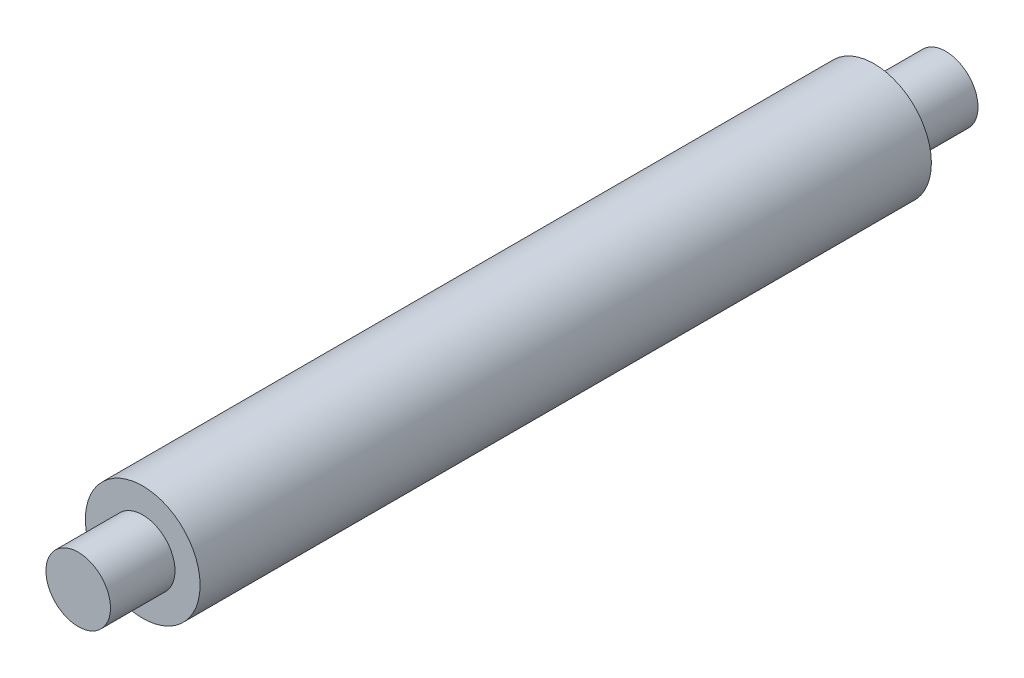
from build123d import *

# Parameters (mm, degrees)
CROQUIS1_R                   = 8
SALIENTE_EXTRUIR1_DEPTH      = 102
SALIENTE_EXTRUIR2_DEPTH      = 9
SALIENTE_EXTRUIR2_DEPTH_BACK = 112
CROQUIS2_R                   = 4.5


with BuildPart() as part:
    # Croquis1 → Saliente-Extruir1 (new body)
    with BuildSketch(Plane.XY):
        Circle(CROQUIS1_R)
    extrude(amount=SALIENTE_EXTRUIR1_DEPTH)

    # Croquis2 → Saliente-Extruir2 (add, two sides: drawn at the far end of the back side and taken through both)
    with BuildSketch(Plane.XY.offset(102).offset(-SALIENTE_EXTRUIR2_DEPTH_BACK)):
        Circle(CROQUIS2_R)
    extrude(amount=SALIENTE_EXTRUIR2_DEPTH + SALIENTE_EXTRUIR2_DEPTH_BACK)


solid = part.part
